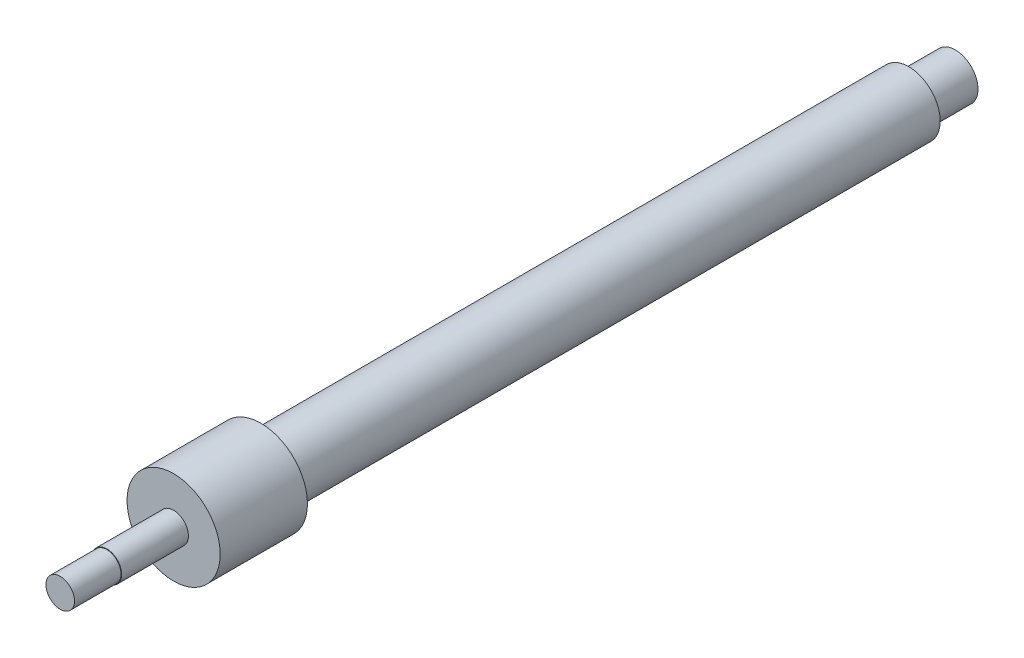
from build123d import *

# Parameters (mm, degrees)
ESBO_O1_R                     = 2.7
RESSALTO_EXTRUS_O1_DEPTH      = 55.66
ESBO_O2_R                     = 1.225
RESSALTO_EXTRUS_O2_DEPTH      = 17.24
ESBO_O3_R                     = 1.95
RESSALTO_EXTRUS_O3_DEPTH      = 4
ESBO_O6_R                     = 1.275
RESSALTO_EXTRUS_O4_DEPTH      = 7
RESSALTO_EXTRUS_O6_DEPTH      = 6.24
RESSALTO_EXTRUS_O6_DEPTH_BACK = 1.26
ESBO_O8_R                     = 4


with BuildPart() as part:
    # Esbo_o1 → Ressalto-extrus_o1 (new body)
    with BuildSketch(Plane.XY):
        Circle(ESBO_O1_R)
    extrude(amount=RESSALTO_EXTRUS_O1_DEPTH)

    # Esbo_o2 → Ressalto-extrus_o2 (add)
    with BuildSketch(Plane.XY.offset(55.66)):
        Circle(ESBO_O2_R)
    extrude(amount=RESSALTO_EXTRUS_O2_DEPTH)

    # Esbo_o3 → Ressalto-extrus_o3 (add)
    with BuildSketch(Plane(origin=(0, 0, 0), x_dir=(-1, 0, 0), z_dir=(0, 0, -1))):
        with Locations(Location((0, 0, 0), (0, 0, 180))):
            Circle(ESBO_O3_R)
    extrude(amount=RESSALTO_EXTRUS_O3_DEPTH)

    # Esbo_o6 → Ressalto-extrus_o4 (add)
    with BuildSketch(Plane.XY.offset(68.9)):
        Circle(ESBO_O6_R)
    extrude(amount=-RESSALTO_EXTRUS_O4_DEPTH)

    # Esbo_o8 → Ressalto-extrus_o6 (add, two sides: drawn at the far end of the back side and taken through both)
    with BuildSketch(Plane(origin=(0, 0, 61.9), x_dir=(-1, 0, 0), z_dir=(0, 0, -1)).offset(-RESSALTO_EXTRUS_O6_DEPTH_BACK)):
        with Locations(Location((0, 0, 0), (0, 0, 180))):
            Circle(ESBO_O8_R)
    extrude(amount=RESSALTO_EXTRUS_O6_DEPTH + RESSALTO_EXTRUS_O6_DEPTH_BACK)


solid = part.part
